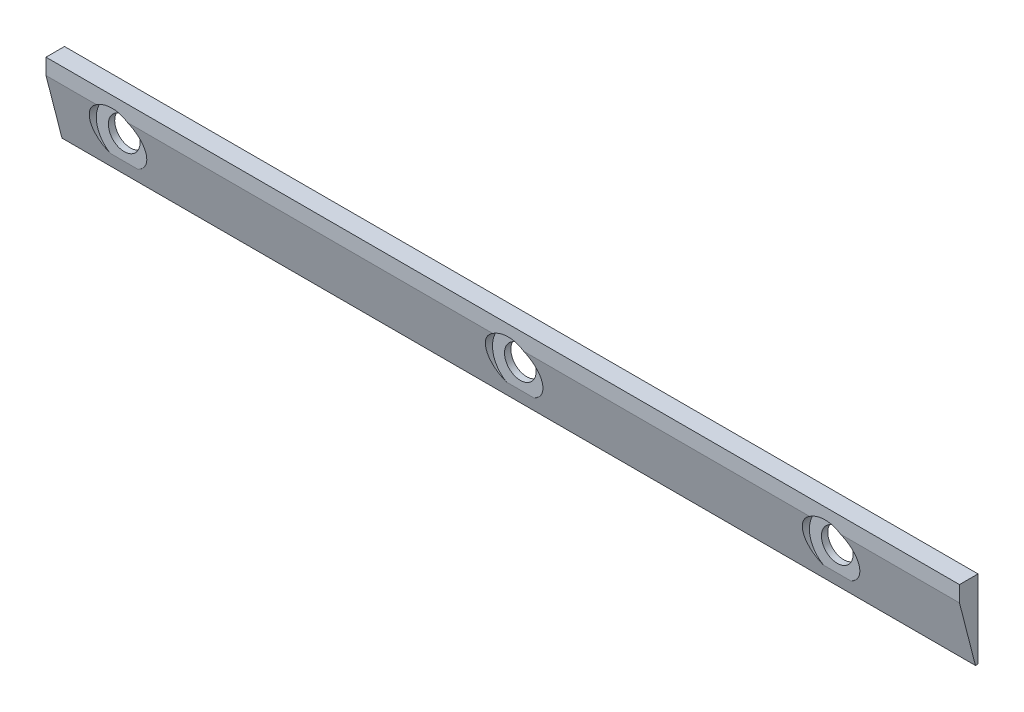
ISO-10303-21;
HEADER;
FILE_DESCRIPTION(('STEP AP214'),'2;1');
FILE_NAME('part.step','',(''),(''),'','','');
FILE_SCHEMA(('AUTOMOTIVE_DESIGN { 1 0 10303 214 1 1 1 1 }'));
ENDSEC;
DATA;
#1=APPLICATION_CONTEXT('core data for automotive mechanical design processes');
#2=APPLICATION_PROTOCOL_DEFINITION('international standard','automotive_design',2000,#1);
#3=PRODUCT_CONTEXT('',#1,'mechanical');
#4=PRODUCT('Part','Part','',(#3));
#5=PRODUCT_RELATED_PRODUCT_CATEGORY('part','',(#4));
#6=PRODUCT_DEFINITION_FORMATION('','',#4);
#7=PRODUCT_DEFINITION_CONTEXT('part definition',#1,'design');
#8=PRODUCT_DEFINITION('design','',#6,#7);
#9=PRODUCT_DEFINITION_SHAPE('','',#8);
#10=(LENGTH_UNIT() NAMED_UNIT(*) SI_UNIT(.MILLI.,.METRE.));
#11=(NAMED_UNIT(*) PLANE_ANGLE_UNIT() SI_UNIT($,.RADIAN.));
#12=(NAMED_UNIT(*) SI_UNIT($,.STERADIAN.) SOLID_ANGLE_UNIT());
#13=UNCERTAINTY_MEASURE_WITH_UNIT(LENGTH_MEASURE(1.E-05),#10,'distance_accuracy_value','');
#14=(GEOMETRIC_REPRESENTATION_CONTEXT(3) GLOBAL_UNCERTAINTY_ASSIGNED_CONTEXT((#13)) GLOBAL_UNIT_ASSIGNED_CONTEXT((#10,
#11,#12)) REPRESENTATION_CONTEXT('',''));
#15=CARTESIAN_POINT('',(0.,0.,0.));
#16=DIRECTION('',(0.,0.,1.));
#17=DIRECTION('',(1.,0.,0.));
#18=AXIS2_PLACEMENT_3D('',#15,#16,#17);
#19=CARTESIAN_POINT('',(45.7581,0.,0.));
#20=DIRECTION('',(0.,-1.,0.));
#21=DIRECTION('',(0.,0.,-1.));
#22=AXIS2_PLACEMENT_3D('',#19,#20,#21);
#23=PLANE('',#22);
#24=DIRECTION('',(0.,0.,1.));
#25=VECTOR('',#24,1.);
#26=CARTESIAN_POINT('',(-45.7581,0.,0.));
#27=LINE('',#26,#25);
#28=CARTESIAN_POINT('',(-45.7581,0.,0.));
#29=VERTEX_POINT('',#28);
#30=CARTESIAN_POINT('',(-45.7581,0.,1.8542));
#31=VERTEX_POINT('',#30);
#32=EDGE_CURVE('E172',#29,#31,#27,.T.);
#33=ORIENTED_EDGE('',*,*,#32,.T.);
#34=DIRECTION('',(-1.,0.,0.));
#35=VECTOR('',#34,1.);
#36=CARTESIAN_POINT('',(45.7581,0.,1.8542));
#37=LINE('',#36,#35);
#38=CARTESIAN_POINT('',(45.7581,0.,1.8542));
#39=VERTEX_POINT('',#38);
#40=EDGE_CURVE('E208',#39,#31,#37,.T.);
#41=ORIENTED_EDGE('',*,*,#40,.F.);
#42=DIRECTION('',(0.,0.,1.));
#43=VECTOR('',#42,1.);
#44=CARTESIAN_POINT('',(45.7581,0.,0.));
#45=LINE('',#44,#43);
#46=CARTESIAN_POINT('',(45.7581,0.,0.));
#47=VERTEX_POINT('',#46);
#48=EDGE_CURVE('E173',#47,#39,#45,.T.);
#49=ORIENTED_EDGE('',*,*,#48,.F.);
#50=DIRECTION('',(-1.,0.,0.));
#51=VECTOR('',#50,1.);
#52=CARTESIAN_POINT('',(45.7581,0.,0.));
#53=LINE('',#52,#51);
#54=EDGE_CURVE('E185',#47,#29,#53,.T.);
#55=ORIENTED_EDGE('',*,*,#54,.T.);
#56=EDGE_LOOP('',(#33,#41,#49,#55));
#57=FACE_BOUND('',#56,.T.);
#58=ADVANCED_FACE('F35',(#57),#23,.F.);
#59=CARTESIAN_POINT('',(45.7581,0.,1.8542));
#60=DIRECTION('',(0.,0.,-1.));
#61=DIRECTION('',(0.,1.,0.));
#62=AXIS2_PLACEMENT_3D('',#59,#60,#61);
#63=PLANE('',#62);
#64=DIRECTION('',(-1.,0.,0.));
#65=VECTOR('',#64,1.);
#66=CARTESIAN_POINT('',(45.7581,-1.5875,1.8542));
#67=LINE('',#66,#65);
#68=CARTESIAN_POINT('',(-40.6922046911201,-1.5875,1.8542));
#69=VERTEX_POINT('',#68);
#70=CARTESIAN_POINT('',(-45.7581,-1.5875,1.8542));
#71=VERTEX_POINT('',#70);
#72=EDGE_CURVE('E204',#69,#71,#67,.T.);
#73=ORIENTED_EDGE('',*,*,#72,.F.);
#74=CARTESIAN_POINT('',(-39.1414,-3.9116,1.8542));
#75=DIRECTION('',(0.,0.,-1.));
#76=DIRECTION('',(0.,1.,0.));
#77=AXIS2_PLACEMENT_3D('',#74,#75,#76);
#78=CIRCLE('',#77,2.794);
#79=CARTESIAN_POINT('',(-37.5905953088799,-1.5875,1.8542));
#80=VERTEX_POINT('',#79);
#81=EDGE_CURVE('E124',#69,#80,#78,.T.);
#82=ORIENTED_EDGE('',*,*,#81,.T.);
#83=CARTESIAN_POINT('',(-1.00470469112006,-1.5875,1.8542));
#84=VERTEX_POINT('',#83);
#85=EDGE_CURVE('E130',#84,#80,#67,.T.);
#86=ORIENTED_EDGE('',*,*,#85,.F.);
#87=CARTESIAN_POINT('',(0.546100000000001,-3.9116,1.8542));
#88=DIRECTION('',(0.,0.,-1.));
#89=DIRECTION('',(0.,1.,0.));
#90=AXIS2_PLACEMENT_3D('',#87,#88,#89);
#91=CIRCLE('',#90,2.794);
#92=CARTESIAN_POINT('',(2.09690469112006,-1.5875,1.8542));
#93=VERTEX_POINT('',#92);
#94=EDGE_CURVE('E147',#84,#93,#91,.T.);
#95=ORIENTED_EDGE('',*,*,#94,.T.);
#96=CARTESIAN_POINT('',(30.7452953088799,-1.5875,1.8542));
#97=VERTEX_POINT('',#96);
#98=EDGE_CURVE('E209',#97,#93,#67,.T.);
#99=ORIENTED_EDGE('',*,*,#98,.F.);
#100=CARTESIAN_POINT('',(32.2961,-3.9116,1.8542));
#101=DIRECTION('',(0.,0.,-1.));
#102=DIRECTION('',(0.,1.,0.));
#103=AXIS2_PLACEMENT_3D('',#100,#101,#102);
#104=CIRCLE('',#103,2.794);
#105=CARTESIAN_POINT('',(33.8469046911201,-1.5875,1.8542));
#106=VERTEX_POINT('',#105);
#107=EDGE_CURVE('E154',#97,#106,#104,.T.);
#108=ORIENTED_EDGE('',*,*,#107,.T.);
#109=CARTESIAN_POINT('',(45.7581,-1.5875,1.8542));
#110=VERTEX_POINT('',#109);
#111=EDGE_CURVE('E205',#110,#106,#67,.T.);
#112=ORIENTED_EDGE('',*,*,#111,.F.);
#113=DIRECTION('',(0.,-1.,0.));
#114=VECTOR('',#113,1.);
#115=CARTESIAN_POINT('',(45.7581,0.,1.8542));
#116=LINE('',#115,#114);
#117=EDGE_CURVE('E176',#39,#110,#116,.T.);
#118=ORIENTED_EDGE('',*,*,#117,.F.);
#119=ORIENTED_EDGE('',*,*,#40,.T.);
#120=DIRECTION('',(0.,-1.,0.));
#121=VECTOR('',#120,1.);
#122=CARTESIAN_POINT('',(-45.7581,0.,1.8542));
#123=LINE('',#122,#121);
#124=EDGE_CURVE('E188',#31,#71,#123,.T.);
#125=ORIENTED_EDGE('',*,*,#124,.T.);
#126=EDGE_LOOP('',(#73,#82,#86,#95,#99,#108,#112,#118,#119,#125));
#127=FACE_BOUND('',#126,.T.);
#128=ADVANCED_FACE('F220',(#127),#63,.F.);
#129=CARTESIAN_POINT('',(45.7581,-7.8232,0.253999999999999));
#130=DIRECTION('',(0.,0.248565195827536,-0.968615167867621));
#131=DIRECTION('',(0.,0.968615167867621,0.248565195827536));
#132=AXIS2_PLACEMENT_3D('',#129,#130,#131);
#133=PLANE('',#132);
#134=DIRECTION('',(-1.,0.,0.));
#135=VECTOR('',#134,1.);
#136=CARTESIAN_POINT('',(45.7581,-6.33850952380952,0.634999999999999));
#137=LINE('',#136,#135);
#138=CARTESIAN_POINT('',(-37.7570062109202,-6.33850952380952,0.634999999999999));
#139=VERTEX_POINT('',#138);
#140=CARTESIAN_POINT('',(-40.5257937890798,-6.33850952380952,0.634999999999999));
#141=VERTEX_POINT('',#140);
#142=EDGE_CURVE('E115',#139,#141,#137,.T.);
#143=ORIENTED_EDGE('',*,*,#142,.T.);
#144=CARTESIAN_POINT('',(-39.1414,-3.9116,1.25779144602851));
#145=DIRECTION('',(0.,0.248565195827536,-0.968615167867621));
#146=DIRECTION('',(0.,-0.968615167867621,-0.248565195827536));
#147=AXIS2_PLACEMENT_3D('',#144,#145,#146);
#148=ELLIPSE('',#147,2.88453050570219,2.794);
#149=EDGE_CURVE('E11',#141,#69,#148,.T.);
#150=ORIENTED_EDGE('',*,*,#149,.T.);
#151=ORIENTED_EDGE('',*,*,#72,.T.);
#152=DIRECTION('',(0.,-0.96861516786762,-0.248565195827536));
#153=VECTOR('',#152,1.);
#154=CARTESIAN_POINT('',(-45.7581,-7.8232,0.253999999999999));
#155=LINE('',#154,#153);
#156=CARTESIAN_POINT('',(-45.7581,-7.8232,0.253999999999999));
#157=VERTEX_POINT('',#156);
#158=EDGE_CURVE('E191',#71,#157,#155,.T.);
#159=ORIENTED_EDGE('',*,*,#158,.T.);
#160=DIRECTION('',(-1.,0.,0.));
#161=VECTOR('',#160,1.);
#162=CARTESIAN_POINT('',(45.7581,-7.8232,0.253999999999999));
#163=LINE('',#162,#161);
#164=CARTESIAN_POINT('',(45.7581,-7.8232,0.253999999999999));
#165=VERTEX_POINT('',#164);
#166=EDGE_CURVE('E201',#165,#157,#163,.T.);
#167=ORIENTED_EDGE('',*,*,#166,.F.);
#168=DIRECTION('',(0.,-0.96861516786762,-0.248565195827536));
#169=VECTOR('',#168,1.);
#170=CARTESIAN_POINT('',(45.7581,-7.8232,0.253999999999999));
#171=LINE('',#170,#169);
#172=EDGE_CURVE('E179',#110,#165,#171,.T.);
#173=ORIENTED_EDGE('',*,*,#172,.F.);
#174=ORIENTED_EDGE('',*,*,#111,.T.);
#175=CARTESIAN_POINT('',(32.2961,-3.9116,1.25779144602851));
#176=DIRECTION('',(0.,0.248565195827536,-0.968615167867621));
#177=DIRECTION('',(0.,-0.968615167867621,-0.248565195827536));
#178=AXIS2_PLACEMENT_3D('',#175,#176,#177);
#179=ELLIPSE('',#178,2.88453050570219,2.794);
#180=CARTESIAN_POINT('',(33.6804937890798,-6.33850952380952,0.634999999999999));
#181=VERTEX_POINT('',#180);
#182=EDGE_CURVE('E212',#106,#181,#179,.T.);
#183=ORIENTED_EDGE('',*,*,#182,.T.);
#184=DIRECTION('',(-1.,0.,0.));
#185=VECTOR('',#184,1.);
#186=CARTESIAN_POINT('',(45.7581,-6.33850952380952,0.634999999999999));
#187=LINE('',#186,#185);
#188=CARTESIAN_POINT('',(30.9117062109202,-6.33850952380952,0.634999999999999));
#189=VERTEX_POINT('',#188);
#190=EDGE_CURVE('E160',#181,#189,#187,.T.);
#191=ORIENTED_EDGE('',*,*,#190,.T.);
#192=EDGE_CURVE('E136',#189,#97,#179,.T.);
#193=ORIENTED_EDGE('',*,*,#192,.T.);
#194=ORIENTED_EDGE('',*,*,#98,.T.);
#195=CARTESIAN_POINT('',(0.546100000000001,-3.9116,1.25779144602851));
#196=DIRECTION('',(0.,0.248565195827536,-0.968615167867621));
#197=DIRECTION('',(0.,-0.968615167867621,-0.248565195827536));
#198=AXIS2_PLACEMENT_3D('',#195,#196,#197);
#199=ELLIPSE('',#198,2.88453050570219,2.794);
#200=CARTESIAN_POINT('',(1.93049378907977,-6.33850952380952,0.634999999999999));
#201=VERTEX_POINT('',#200);
#202=EDGE_CURVE('E132',#93,#201,#199,.T.);
#203=ORIENTED_EDGE('',*,*,#202,.T.);
#204=DIRECTION('',(-1.,0.,0.));
#205=VECTOR('',#204,1.);
#206=CARTESIAN_POINT('',(45.7581,-6.33850952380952,0.634999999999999));
#207=LINE('',#206,#205);
#208=CARTESIAN_POINT('',(-0.838293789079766,-6.33850952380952,0.634999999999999));
#209=VERTEX_POINT('',#208);
#210=EDGE_CURVE('E151',#201,#209,#207,.T.);
#211=ORIENTED_EDGE('',*,*,#210,.T.);
#212=EDGE_CURVE('E131',#209,#84,#199,.T.);
#213=ORIENTED_EDGE('',*,*,#212,.T.);
#214=ORIENTED_EDGE('',*,*,#85,.T.);
#215=EDGE_CURVE('E38',#80,#139,#148,.T.);
#216=ORIENTED_EDGE('',*,*,#215,.T.);
#217=EDGE_LOOP('',(#143,#150,#151,#159,#167,#173,#174,#183,#191,#193,#194,#203,#211,#213,#214,#216));
#218=FACE_BOUND('',#217,.T.);
#219=ADVANCED_FACE('F127',(#218),#133,.F.);
#220=CARTESIAN_POINT('',(45.7581,-7.8232,0.));
#221=DIRECTION('',(0.,1.,0.));
#222=DIRECTION('',(0.,0.,1.));
#223=AXIS2_PLACEMENT_3D('',#220,#221,#222);
#224=PLANE('',#223);
#225=DIRECTION('',(0.,0.,-1.));
#226=VECTOR('',#225,1.);
#227=CARTESIAN_POINT('',(-45.7581,-7.8232,0.));
#228=LINE('',#227,#226);
#229=CARTESIAN_POINT('',(-45.7581,-7.8232,0.));
#230=VERTEX_POINT('',#229);
#231=EDGE_CURVE('E193',#157,#230,#228,.T.);
#232=ORIENTED_EDGE('',*,*,#231,.T.);
#233=DIRECTION('',(-1.,0.,0.));
#234=VECTOR('',#233,1.);
#235=CARTESIAN_POINT('',(45.7581,-7.8232,0.));
#236=LINE('',#235,#234);
#237=CARTESIAN_POINT('',(45.7581,-7.8232,0.));
#238=VERTEX_POINT('',#237);
#239=EDGE_CURVE('E198',#238,#230,#236,.T.);
#240=ORIENTED_EDGE('',*,*,#239,.F.);
#241=DIRECTION('',(0.,0.,-1.));
#242=VECTOR('',#241,1.);
#243=CARTESIAN_POINT('',(45.7581,-7.8232,0.));
#244=LINE('',#243,#242);
#245=EDGE_CURVE('E181',#165,#238,#244,.T.);
#246=ORIENTED_EDGE('',*,*,#245,.F.);
#247=ORIENTED_EDGE('',*,*,#166,.T.);
#248=EDGE_LOOP('',(#232,#240,#246,#247));
#249=FACE_BOUND('',#248,.T.);
#250=ADVANCED_FACE('F232',(#249),#224,.F.);
#251=CARTESIAN_POINT('',(45.7581,0.,0.));
#252=DIRECTION('',(0.,0.,1.));
#253=DIRECTION('',(0.,-1.,0.));
#254=AXIS2_PLACEMENT_3D('',#251,#252,#253);
#255=PLANE('',#254);
#256=CARTESIAN_POINT('',(-39.1414,-3.9116,0.));
#257=DIRECTION('',(0.,0.,-1.));
#258=DIRECTION('',(0.,1.,0.));
#259=AXIS2_PLACEMENT_3D('',#256,#257,#258);
#260=CIRCLE('',#259,1.5875);
#261=CARTESIAN_POINT('',(-39.1414,-2.3241,0.));
#262=VERTEX_POINT('',#261);
#263=EDGE_CURVE('E163',#262,#262,#260,.T.);
#264=ORIENTED_EDGE('',*,*,#263,.F.);
#265=EDGE_LOOP('',(#264));
#266=FACE_BOUND('',#265,.T.);
#267=CARTESIAN_POINT('',(0.546100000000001,-3.9116,0.));
#268=DIRECTION('',(0.,0.,-1.));
#269=DIRECTION('',(0.,1.,0.));
#270=AXIS2_PLACEMENT_3D('',#267,#268,#269);
#271=CIRCLE('',#270,1.5875);
#272=CARTESIAN_POINT('',(0.546100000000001,-2.3241,0.));
#273=VERTEX_POINT('',#272);
#274=EDGE_CURVE('E166',#273,#273,#271,.T.);
#275=ORIENTED_EDGE('',*,*,#274,.F.);
#276=EDGE_LOOP('',(#275));
#277=FACE_BOUND('',#276,.T.);
#278=CARTESIAN_POINT('',(32.2961,-3.9116,0.));
#279=DIRECTION('',(0.,0.,-1.));
#280=DIRECTION('',(0.,1.,0.));
#281=AXIS2_PLACEMENT_3D('',#278,#279,#280);
#282=CIRCLE('',#281,1.5875);
#283=CARTESIAN_POINT('',(32.2961,-2.3241,0.));
#284=VERTEX_POINT('',#283);
#285=EDGE_CURVE('E169',#284,#284,#282,.T.);
#286=ORIENTED_EDGE('',*,*,#285,.F.);
#287=EDGE_LOOP('',(#286));
#288=FACE_BOUND('',#287,.T.);
#289=DIRECTION('',(0.,1.,0.));
#290=VECTOR('',#289,1.);
#291=CARTESIAN_POINT('',(-45.7581,0.,0.));
#292=LINE('',#291,#290);
#293=EDGE_CURVE('E177',#230,#29,#292,.T.);
#294=ORIENTED_EDGE('',*,*,#293,.T.);
#295=ORIENTED_EDGE('',*,*,#54,.F.);
#296=DIRECTION('',(0.,1.,0.));
#297=VECTOR('',#296,1.);
#298=CARTESIAN_POINT('',(45.7581,0.,0.));
#299=LINE('',#298,#297);
#300=EDGE_CURVE('E183',#238,#47,#299,.T.);
#301=ORIENTED_EDGE('',*,*,#300,.F.);
#302=ORIENTED_EDGE('',*,*,#239,.T.);
#303=EDGE_LOOP('',(#294,#295,#301,#302));
#304=FACE_BOUND('',#303,.T.);
#305=ADVANCED_FACE('F236',(#266,#277,#288,#304),#255,.F.);
#306=CARTESIAN_POINT('',(45.7581,0.,0.));
#307=DIRECTION('',(1.,0.,0.));
#308=DIRECTION('',(0.,0.,-1.));
#309=AXIS2_PLACEMENT_3D('',#306,#307,#308);
#310=PLANE('',#309);
#311=ORIENTED_EDGE('',*,*,#48,.T.);
#312=ORIENTED_EDGE('',*,*,#117,.T.);
#313=ORIENTED_EDGE('',*,*,#172,.T.);
#314=ORIENTED_EDGE('',*,*,#245,.T.);
#315=ORIENTED_EDGE('',*,*,#300,.T.);
#316=EDGE_LOOP('',(#311,#312,#313,#314,#315));
#317=FACE_BOUND('',#316,.T.);
#318=ADVANCED_FACE('F240',(#317),#310,.T.);
#319=CARTESIAN_POINT('',(-45.7581,0.,0.));
#320=DIRECTION('',(1.,0.,0.));
#321=DIRECTION('',(0.,0.,-1.));
#322=AXIS2_PLACEMENT_3D('',#319,#320,#321);
#323=PLANE('',#322);
#324=ORIENTED_EDGE('',*,*,#32,.F.);
#325=ORIENTED_EDGE('',*,*,#293,.F.);
#326=ORIENTED_EDGE('',*,*,#231,.F.);
#327=ORIENTED_EDGE('',*,*,#158,.F.);
#328=ORIENTED_EDGE('',*,*,#124,.F.);
#329=EDGE_LOOP('',(#324,#325,#326,#327,#328));
#330=FACE_BOUND('',#329,.T.);
#331=ADVANCED_FACE('F228',(#330),#323,.F.);
#332=CARTESIAN_POINT('',(32.2961,-3.9116,1.8542));
#333=DIRECTION('',(0.,0.,-1.));
#334=DIRECTION('',(0.,1.,0.));
#335=AXIS2_PLACEMENT_3D('',#332,#333,#334);
#336=CYLINDRICAL_SURFACE('',#335,1.5875);
#337=CARTESIAN_POINT('',(32.2961,-3.9116,0.635));
#338=DIRECTION('',(0.,0.,-1.));
#339=DIRECTION('',(0.,1.,0.));
#340=AXIS2_PLACEMENT_3D('',#337,#338,#339);
#341=CIRCLE('',#340,1.5875);
#342=CARTESIAN_POINT('',(32.2961,-2.3241,0.635));
#343=VERTEX_POINT('',#342);
#344=EDGE_CURVE('E157',#343,#343,#341,.F.);
#345=CARTESIAN_POINT('',(32.2961,-2.3241,0.635));
#346=CARTESIAN_POINT('',(32.2961,-2.3241,0.628385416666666));
#347=CARTESIAN_POINT('',(32.2961,-2.3241,0.621770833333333));
#348=CARTESIAN_POINT('',(32.2961,-2.3241,0.608541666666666));
#349=CARTESIAN_POINT('',(32.2961,-2.3241,0.601927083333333));
#350=CARTESIAN_POINT('',(32.2961,-2.3241,0.588697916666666));
#351=CARTESIAN_POINT('',(32.2961,-2.3241,0.582083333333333));
#352=CARTESIAN_POINT('',(32.2961,-2.3241,0.568854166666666));
#353=CARTESIAN_POINT('',(32.2961,-2.3241,0.562239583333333));
#354=CARTESIAN_POINT('',(32.2961,-2.3241,0.549010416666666));
#355=CARTESIAN_POINT('',(32.2961,-2.3241,0.542395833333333));
#356=CARTESIAN_POINT('',(32.2961,-2.3241,0.529166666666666));
#357=CARTESIAN_POINT('',(32.2961,-2.3241,0.522552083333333));
#358=CARTESIAN_POINT('',(32.2961,-2.3241,0.509322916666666));
#359=CARTESIAN_POINT('',(32.2961,-2.3241,0.502708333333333));
#360=CARTESIAN_POINT('',(32.2961,-2.3241,0.489479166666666));
#361=CARTESIAN_POINT('',(32.2961,-2.3241,0.482864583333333));
#362=CARTESIAN_POINT('',(32.2961,-2.3241,0.469635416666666));
#363=CARTESIAN_POINT('',(32.2961,-2.3241,0.463020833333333));
#364=CARTESIAN_POINT('',(32.2961,-2.3241,0.449791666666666));
#365=CARTESIAN_POINT('',(32.2961,-2.3241,0.443177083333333));
#366=CARTESIAN_POINT('',(32.2961,-2.3241,0.429947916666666));
#367=CARTESIAN_POINT('',(32.2961,-2.3241,0.423333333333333));
#368=CARTESIAN_POINT('',(32.2961,-2.3241,0.410104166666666));
#369=CARTESIAN_POINT('',(32.2961,-2.3241,0.403489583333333));
#370=CARTESIAN_POINT('',(32.2961,-2.3241,0.390260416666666));
#371=CARTESIAN_POINT('',(32.2961,-2.3241,0.383645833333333));
#372=CARTESIAN_POINT('',(32.2961,-2.3241,0.370416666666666));
#373=CARTESIAN_POINT('',(32.2961,-2.3241,0.363802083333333));
#374=CARTESIAN_POINT('',(32.2961,-2.3241,0.350572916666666));
#375=CARTESIAN_POINT('',(32.2961,-2.3241,0.343958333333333));
#376=CARTESIAN_POINT('',(32.2961,-2.3241,0.330729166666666));
#377=CARTESIAN_POINT('',(32.2961,-2.3241,0.324114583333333));
#378=CARTESIAN_POINT('',(32.2961,-2.3241,0.310885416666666));
#379=CARTESIAN_POINT('',(32.2961,-2.3241,0.304270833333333));
#380=CARTESIAN_POINT('',(32.2961,-2.3241,0.291041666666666));
#381=CARTESIAN_POINT('',(32.2961,-2.3241,0.284427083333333));
#382=CARTESIAN_POINT('',(32.2961,-2.3241,0.271197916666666));
#383=CARTESIAN_POINT('',(32.2961,-2.3241,0.264583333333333));
#384=CARTESIAN_POINT('',(32.2961,-2.3241,0.251354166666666));
#385=CARTESIAN_POINT('',(32.2961,-2.3241,0.244739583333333));
#386=CARTESIAN_POINT('',(32.2961,-2.3241,0.231510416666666));
#387=CARTESIAN_POINT('',(32.2961,-2.3241,0.224895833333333));
#388=CARTESIAN_POINT('',(32.2961,-2.3241,0.211666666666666));
#389=CARTESIAN_POINT('',(32.2961,-2.3241,0.205052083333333));
#390=CARTESIAN_POINT('',(32.2961,-2.3241,0.191822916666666));
#391=CARTESIAN_POINT('',(32.2961,-2.3241,0.185208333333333));
#392=CARTESIAN_POINT('',(32.2961,-2.3241,0.171979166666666));
#393=CARTESIAN_POINT('',(32.2961,-2.3241,0.165364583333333));
#394=CARTESIAN_POINT('',(32.2961,-2.3241,0.152135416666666));
#395=CARTESIAN_POINT('',(32.2961,-2.3241,0.145520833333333));
#396=CARTESIAN_POINT('',(32.2961,-2.3241,0.132291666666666));
#397=CARTESIAN_POINT('',(32.2961,-2.3241,0.125677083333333));
#398=CARTESIAN_POINT('',(32.2961,-2.3241,0.112447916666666));
#399=CARTESIAN_POINT('',(32.2961,-2.3241,0.105833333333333));
#400=CARTESIAN_POINT('',(32.2961,-2.3241,0.0926041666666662));
#401=CARTESIAN_POINT('',(32.2961,-2.3241,0.0859895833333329));
#402=CARTESIAN_POINT('',(32.2961,-2.3241,0.0727604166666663));
#403=CARTESIAN_POINT('',(32.2961,-2.3241,0.066145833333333));
#404=CARTESIAN_POINT('',(32.2961,-2.3241,0.0529166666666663));
#405=CARTESIAN_POINT('',(32.2961,-2.3241,0.0463020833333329));
#406=CARTESIAN_POINT('',(32.2961,-2.3241,0.0330729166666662));
#407=CARTESIAN_POINT('',(32.2961,-2.3241,0.0264583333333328));
#408=CARTESIAN_POINT('',(32.2961,-2.3241,0.0132291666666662));
#409=CARTESIAN_POINT('',(32.2961,-2.3241,0.00661458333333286));
#410=CARTESIAN_POINT('',(32.2961,-2.3241,0.));
#411=B_SPLINE_CURVE_WITH_KNOTS('',3,(#345,#346,#347,#348,#349,#350,#351,#352,#353,#354,#355,
#356,#357,#358,#359,#360,#361,#362,#363,#364,#365,#366,#367,#368,#369,#370,#371,#372,#373,#374,
#375,#376,#377,#378,#379,#380,#381,#382,#383,#384,#385,#386,#387,#388,#389,#390,#391,#392,#393,
#394,#395,#396,#397,#398,#399,#400,#401,#402,#403,#404,#405,#406,#407,#408,#409,#410),
.UNSPECIFIED.,.F.,.F.,(4,2,2,2,2,2,2,2,2,2,2,2,2,2,2,2,2,2,2,2,2,2,2,2,2,2,2,2,2,2,2,2,4),(0.,
0.0198437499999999,0.0396875,0.0595312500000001,0.079375,0.0992187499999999,0.1190625,
0.13890625,0.15875,0.17859375,0.1984375,0.21828125,0.238125,0.25796875,0.2778125,0.29765625,
0.3175,0.33734375,0.3571875,0.37703125,0.396875,0.41671875,0.4365625,0.45640625,0.47625,
0.49609375,0.5159375,0.53578125,0.555625,0.57546875,0.5953125,0.61515625,0.635),.UNSPECIFIED.);
#412=EDGE_CURVE('BSEAM259',#343,#284,#411,.T.);
#413=ORIENTED_EDGE('',*,*,#344,.T.);
#414=ORIENTED_EDGE('',*,*,#285,.T.);
#415=ORIENTED_EDGE('',*,*,#412,.T.);
#416=ORIENTED_EDGE('',*,*,#412,.F.);
#417=EDGE_LOOP('',(#413,#415,#414,#416));
#418=FACE_BOUND('',#417,.T.);
#419=ADVANCED_FACE('F259',(#418),#336,.F.);
#420=CARTESIAN_POINT('',(0.546100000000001,-3.9116,1.8542));
#421=DIRECTION('',(0.,0.,-1.));
#422=DIRECTION('',(0.,1.,0.));
#423=AXIS2_PLACEMENT_3D('',#420,#421,#422);
#424=CYLINDRICAL_SURFACE('',#423,1.5875);
#425=CARTESIAN_POINT('',(0.546100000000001,-3.9116,0.635));
#426=DIRECTION('',(0.,0.,-1.));
#427=DIRECTION('',(0.,1.,0.));
#428=AXIS2_PLACEMENT_3D('',#425,#426,#427);
#429=CIRCLE('',#428,1.5875);
#430=CARTESIAN_POINT('',(0.546100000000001,-2.3241,0.635));
#431=VERTEX_POINT('',#430);
#432=EDGE_CURVE('E138',#431,#431,#429,.F.);
#433=CARTESIAN_POINT('',(0.546100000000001,-2.3241,0.635));
#434=CARTESIAN_POINT('',(0.546100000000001,-2.3241,0.628385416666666));
#435=CARTESIAN_POINT('',(0.546100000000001,-2.3241,0.621770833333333));
#436=CARTESIAN_POINT('',(0.546100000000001,-2.3241,0.608541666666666));
#437=CARTESIAN_POINT('',(0.546100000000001,-2.3241,0.601927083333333));
#438=CARTESIAN_POINT('',(0.546100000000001,-2.3241,0.588697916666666));
#439=CARTESIAN_POINT('',(0.546100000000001,-2.3241,0.582083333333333));
#440=CARTESIAN_POINT('',(0.546100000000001,-2.3241,0.568854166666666));
#441=CARTESIAN_POINT('',(0.546100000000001,-2.3241,0.562239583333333));
#442=CARTESIAN_POINT('',(0.546100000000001,-2.3241,0.549010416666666));
#443=CARTESIAN_POINT('',(0.546100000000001,-2.3241,0.542395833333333));
#444=CARTESIAN_POINT('',(0.546100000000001,-2.3241,0.529166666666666));
#445=CARTESIAN_POINT('',(0.546100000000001,-2.3241,0.522552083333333));
#446=CARTESIAN_POINT('',(0.546100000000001,-2.3241,0.509322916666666));
#447=CARTESIAN_POINT('',(0.546100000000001,-2.3241,0.502708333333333));
#448=CARTESIAN_POINT('',(0.546100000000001,-2.3241,0.489479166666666));
#449=CARTESIAN_POINT('',(0.546100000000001,-2.3241,0.482864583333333));
#450=CARTESIAN_POINT('',(0.546100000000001,-2.3241,0.469635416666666));
#451=CARTESIAN_POINT('',(0.546100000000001,-2.3241,0.463020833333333));
#452=CARTESIAN_POINT('',(0.546100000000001,-2.3241,0.449791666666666));
#453=CARTESIAN_POINT('',(0.546100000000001,-2.3241,0.443177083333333));
#454=CARTESIAN_POINT('',(0.546100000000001,-2.3241,0.429947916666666));
#455=CARTESIAN_POINT('',(0.546100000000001,-2.3241,0.423333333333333));
#456=CARTESIAN_POINT('',(0.546100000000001,-2.3241,0.410104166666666));
#457=CARTESIAN_POINT('',(0.546100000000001,-2.3241,0.403489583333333));
#458=CARTESIAN_POINT('',(0.546100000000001,-2.3241,0.390260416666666));
#459=CARTESIAN_POINT('',(0.546100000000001,-2.3241,0.383645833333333));
#460=CARTESIAN_POINT('',(0.546100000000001,-2.3241,0.370416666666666));
#461=CARTESIAN_POINT('',(0.546100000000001,-2.3241,0.363802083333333));
#462=CARTESIAN_POINT('',(0.546100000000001,-2.3241,0.350572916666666));
#463=CARTESIAN_POINT('',(0.546100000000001,-2.3241,0.343958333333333));
#464=CARTESIAN_POINT('',(0.546100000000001,-2.3241,0.330729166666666));
#465=CARTESIAN_POINT('',(0.546100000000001,-2.3241,0.324114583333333));
#466=CARTESIAN_POINT('',(0.546100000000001,-2.3241,0.310885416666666));
#467=CARTESIAN_POINT('',(0.546100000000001,-2.3241,0.304270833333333));
#468=CARTESIAN_POINT('',(0.546100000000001,-2.3241,0.291041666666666));
#469=CARTESIAN_POINT('',(0.546100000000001,-2.3241,0.284427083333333));
#470=CARTESIAN_POINT('',(0.546100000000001,-2.3241,0.271197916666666));
#471=CARTESIAN_POINT('',(0.546100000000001,-2.3241,0.264583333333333));
#472=CARTESIAN_POINT('',(0.546100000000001,-2.3241,0.251354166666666));
#473=CARTESIAN_POINT('',(0.546100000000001,-2.3241,0.244739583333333));
#474=CARTESIAN_POINT('',(0.546100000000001,-2.3241,0.231510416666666));
#475=CARTESIAN_POINT('',(0.546100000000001,-2.3241,0.224895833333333));
#476=CARTESIAN_POINT('',(0.546100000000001,-2.3241,0.211666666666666));
#477=CARTESIAN_POINT('',(0.546100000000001,-2.3241,0.205052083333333));
#478=CARTESIAN_POINT('',(0.546100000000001,-2.3241,0.191822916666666));
#479=CARTESIAN_POINT('',(0.546100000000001,-2.3241,0.185208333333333));
#480=CARTESIAN_POINT('',(0.546100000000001,-2.3241,0.171979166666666));
#481=CARTESIAN_POINT('',(0.546100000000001,-2.3241,0.165364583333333));
#482=CARTESIAN_POINT('',(0.546100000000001,-2.3241,0.152135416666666));
#483=CARTESIAN_POINT('',(0.546100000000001,-2.3241,0.145520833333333));
#484=CARTESIAN_POINT('',(0.546100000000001,-2.3241,0.132291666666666));
#485=CARTESIAN_POINT('',(0.546100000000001,-2.3241,0.125677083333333));
#486=CARTESIAN_POINT('',(0.546100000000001,-2.3241,0.112447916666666));
#487=CARTESIAN_POINT('',(0.546100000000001,-2.3241,0.105833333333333));
#488=CARTESIAN_POINT('',(0.546100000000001,-2.3241,0.0926041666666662));
#489=CARTESIAN_POINT('',(0.546100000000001,-2.3241,0.0859895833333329));
#490=CARTESIAN_POINT('',(0.546100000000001,-2.3241,0.0727604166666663));
#491=CARTESIAN_POINT('',(0.546100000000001,-2.3241,0.066145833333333));
#492=CARTESIAN_POINT('',(0.546100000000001,-2.3241,0.0529166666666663));
#493=CARTESIAN_POINT('',(0.546100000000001,-2.3241,0.0463020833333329));
#494=CARTESIAN_POINT('',(0.546100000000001,-2.3241,0.0330729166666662));
#495=CARTESIAN_POINT('',(0.546100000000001,-2.3241,0.0264583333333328));
#496=CARTESIAN_POINT('',(0.546100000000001,-2.3241,0.0132291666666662));
#497=CARTESIAN_POINT('',(0.546100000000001,-2.3241,0.00661458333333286));
#498=CARTESIAN_POINT('',(0.546100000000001,-2.3241,0.));
#499=B_SPLINE_CURVE_WITH_KNOTS('',3,(#433,#434,#435,#436,#437,#438,#439,#440,#441,#442,#443,
#444,#445,#446,#447,#448,#449,#450,#451,#452,#453,#454,#455,#456,#457,#458,#459,#460,#461,#462,
#463,#464,#465,#466,#467,#468,#469,#470,#471,#472,#473,#474,#475,#476,#477,#478,#479,#480,#481,
#482,#483,#484,#485,#486,#487,#488,#489,#490,#491,#492,#493,#494,#495,#496,#497,#498),
.UNSPECIFIED.,.F.,.F.,(4,2,2,2,2,2,2,2,2,2,2,2,2,2,2,2,2,2,2,2,2,2,2,2,2,2,2,2,2,2,2,2,4),(0.,
0.0198437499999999,0.0396875,0.0595312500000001,0.079375,0.0992187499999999,0.1190625,
0.13890625,0.15875,0.17859375,0.1984375,0.21828125,0.238125,0.25796875,0.2778125,0.29765625,
0.3175,0.33734375,0.3571875,0.37703125,0.396875,0.41671875,0.4365625,0.45640625,0.47625,
0.49609375,0.5159375,0.53578125,0.555625,0.57546875,0.5953125,0.61515625,0.635),.UNSPECIFIED.);
#500=EDGE_CURVE('BSEAM264',#431,#273,#499,.T.);
#501=ORIENTED_EDGE('',*,*,#432,.T.);
#502=ORIENTED_EDGE('',*,*,#274,.T.);
#503=ORIENTED_EDGE('',*,*,#500,.T.);
#504=ORIENTED_EDGE('',*,*,#500,.F.);
#505=EDGE_LOOP('',(#501,#503,#502,#504));
#506=FACE_BOUND('',#505,.T.);
#507=ADVANCED_FACE('F264',(#506),#424,.F.);
#508=CARTESIAN_POINT('',(-39.1414,-3.9116,1.8542));
#509=DIRECTION('',(0.,0.,-1.));
#510=DIRECTION('',(0.,1.,0.));
#511=AXIS2_PLACEMENT_3D('',#508,#509,#510);
#512=CYLINDRICAL_SURFACE('',#511,1.5875);
#513=CARTESIAN_POINT('',(-39.1414,-3.9116,0.635));
#514=DIRECTION('',(0.,0.,-1.));
#515=DIRECTION('',(0.,1.,0.));
#516=AXIS2_PLACEMENT_3D('',#513,#514,#515);
#517=CIRCLE('',#516,1.5875);
#518=CARTESIAN_POINT('',(-39.1414,-2.3241,0.635));
#519=VERTEX_POINT('',#518);
#520=EDGE_CURVE('E119',#519,#519,#517,.F.);
#521=CARTESIAN_POINT('',(-39.1414,-2.3241,0.635));
#522=CARTESIAN_POINT('',(-39.1414,-2.3241,0.628385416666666));
#523=CARTESIAN_POINT('',(-39.1414,-2.3241,0.621770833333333));
#524=CARTESIAN_POINT('',(-39.1414,-2.3241,0.608541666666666));
#525=CARTESIAN_POINT('',(-39.1414,-2.3241,0.601927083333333));
#526=CARTESIAN_POINT('',(-39.1414,-2.3241,0.588697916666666));
#527=CARTESIAN_POINT('',(-39.1414,-2.3241,0.582083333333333));
#528=CARTESIAN_POINT('',(-39.1414,-2.3241,0.568854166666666));
#529=CARTESIAN_POINT('',(-39.1414,-2.3241,0.562239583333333));
#530=CARTESIAN_POINT('',(-39.1414,-2.3241,0.549010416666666));
#531=CARTESIAN_POINT('',(-39.1414,-2.3241,0.542395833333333));
#532=CARTESIAN_POINT('',(-39.1414,-2.3241,0.529166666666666));
#533=CARTESIAN_POINT('',(-39.1414,-2.3241,0.522552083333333));
#534=CARTESIAN_POINT('',(-39.1414,-2.3241,0.509322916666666));
#535=CARTESIAN_POINT('',(-39.1414,-2.3241,0.502708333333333));
#536=CARTESIAN_POINT('',(-39.1414,-2.3241,0.489479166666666));
#537=CARTESIAN_POINT('',(-39.1414,-2.3241,0.482864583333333));
#538=CARTESIAN_POINT('',(-39.1414,-2.3241,0.469635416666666));
#539=CARTESIAN_POINT('',(-39.1414,-2.3241,0.463020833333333));
#540=CARTESIAN_POINT('',(-39.1414,-2.3241,0.449791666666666));
#541=CARTESIAN_POINT('',(-39.1414,-2.3241,0.443177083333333));
#542=CARTESIAN_POINT('',(-39.1414,-2.3241,0.429947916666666));
#543=CARTESIAN_POINT('',(-39.1414,-2.3241,0.423333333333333));
#544=CARTESIAN_POINT('',(-39.1414,-2.3241,0.410104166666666));
#545=CARTESIAN_POINT('',(-39.1414,-2.3241,0.403489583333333));
#546=CARTESIAN_POINT('',(-39.1414,-2.3241,0.390260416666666));
#547=CARTESIAN_POINT('',(-39.1414,-2.3241,0.383645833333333));
#548=CARTESIAN_POINT('',(-39.1414,-2.3241,0.370416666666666));
#549=CARTESIAN_POINT('',(-39.1414,-2.3241,0.363802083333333));
#550=CARTESIAN_POINT('',(-39.1414,-2.3241,0.350572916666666));
#551=CARTESIAN_POINT('',(-39.1414,-2.3241,0.343958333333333));
#552=CARTESIAN_POINT('',(-39.1414,-2.3241,0.330729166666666));
#553=CARTESIAN_POINT('',(-39.1414,-2.3241,0.324114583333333));
#554=CARTESIAN_POINT('',(-39.1414,-2.3241,0.310885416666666));
#555=CARTESIAN_POINT('',(-39.1414,-2.3241,0.304270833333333));
#556=CARTESIAN_POINT('',(-39.1414,-2.3241,0.291041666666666));
#557=CARTESIAN_POINT('',(-39.1414,-2.3241,0.284427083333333));
#558=CARTESIAN_POINT('',(-39.1414,-2.3241,0.271197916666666));
#559=CARTESIAN_POINT('',(-39.1414,-2.3241,0.264583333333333));
#560=CARTESIAN_POINT('',(-39.1414,-2.3241,0.251354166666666));
#561=CARTESIAN_POINT('',(-39.1414,-2.3241,0.244739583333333));
#562=CARTESIAN_POINT('',(-39.1414,-2.3241,0.231510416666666));
#563=CARTESIAN_POINT('',(-39.1414,-2.3241,0.224895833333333));
#564=CARTESIAN_POINT('',(-39.1414,-2.3241,0.211666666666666));
#565=CARTESIAN_POINT('',(-39.1414,-2.3241,0.205052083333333));
#566=CARTESIAN_POINT('',(-39.1414,-2.3241,0.191822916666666));
#567=CARTESIAN_POINT('',(-39.1414,-2.3241,0.185208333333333));
#568=CARTESIAN_POINT('',(-39.1414,-2.3241,0.171979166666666));
#569=CARTESIAN_POINT('',(-39.1414,-2.3241,0.165364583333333));
#570=CARTESIAN_POINT('',(-39.1414,-2.3241,0.152135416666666));
#571=CARTESIAN_POINT('',(-39.1414,-2.3241,0.145520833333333));
#572=CARTESIAN_POINT('',(-39.1414,-2.3241,0.132291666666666));
#573=CARTESIAN_POINT('',(-39.1414,-2.3241,0.125677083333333));
#574=CARTESIAN_POINT('',(-39.1414,-2.3241,0.112447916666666));
#575=CARTESIAN_POINT('',(-39.1414,-2.3241,0.105833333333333));
#576=CARTESIAN_POINT('',(-39.1414,-2.3241,0.0926041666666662));
#577=CARTESIAN_POINT('',(-39.1414,-2.3241,0.0859895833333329));
#578=CARTESIAN_POINT('',(-39.1414,-2.3241,0.0727604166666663));
#579=CARTESIAN_POINT('',(-39.1414,-2.3241,0.066145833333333));
#580=CARTESIAN_POINT('',(-39.1414,-2.3241,0.0529166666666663));
#581=CARTESIAN_POINT('',(-39.1414,-2.3241,0.0463020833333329));
#582=CARTESIAN_POINT('',(-39.1414,-2.3241,0.0330729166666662));
#583=CARTESIAN_POINT('',(-39.1414,-2.3241,0.0264583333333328));
#584=CARTESIAN_POINT('',(-39.1414,-2.3241,0.0132291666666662));
#585=CARTESIAN_POINT('',(-39.1414,-2.3241,0.00661458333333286));
#586=CARTESIAN_POINT('',(-39.1414,-2.3241,0.));
#587=B_SPLINE_CURVE_WITH_KNOTS('',3,(#521,#522,#523,#524,#525,#526,#527,#528,#529,#530,#531,
#532,#533,#534,#535,#536,#537,#538,#539,#540,#541,#542,#543,#544,#545,#546,#547,#548,#549,#550,
#551,#552,#553,#554,#555,#556,#557,#558,#559,#560,#561,#562,#563,#564,#565,#566,#567,#568,#569,
#570,#571,#572,#573,#574,#575,#576,#577,#578,#579,#580,#581,#582,#583,#584,#585,#586),
.UNSPECIFIED.,.F.,.F.,(4,2,2,2,2,2,2,2,2,2,2,2,2,2,2,2,2,2,2,2,2,2,2,2,2,2,2,2,2,2,2,2,4),(0.,
0.0198437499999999,0.0396875,0.0595312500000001,0.079375,0.0992187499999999,0.1190625,
0.13890625,0.15875,0.17859375,0.1984375,0.21828125,0.238125,0.25796875,0.2778125,0.29765625,
0.3175,0.33734375,0.3571875,0.37703125,0.396875,0.41671875,0.4365625,0.45640625,0.47625,
0.49609375,0.5159375,0.53578125,0.555625,0.57546875,0.5953125,0.61515625,0.635),.UNSPECIFIED.);
#588=EDGE_CURVE('BSEAM268',#519,#262,#587,.T.);
#589=ORIENTED_EDGE('',*,*,#520,.T.);
#590=ORIENTED_EDGE('',*,*,#263,.T.);
#591=ORIENTED_EDGE('',*,*,#588,.T.);
#592=ORIENTED_EDGE('',*,*,#588,.F.);
#593=EDGE_LOOP('',(#589,#591,#590,#592));
#594=FACE_BOUND('',#593,.T.);
#595=ADVANCED_FACE('F268',(#594),#512,.F.);
#596=CARTESIAN_POINT('',(32.2961,-3.9116,1.8542));
#597=DIRECTION('',(0.,0.,-1.));
#598=DIRECTION('',(0.,1.,0.));
#599=AXIS2_PLACEMENT_3D('',#596,#597,#598);
#600=CYLINDRICAL_SURFACE('',#599,2.794);
#601=CARTESIAN_POINT('',(32.2961,-3.9116,0.635));
#602=DIRECTION('',(0.,0.,-1.));
#603=DIRECTION('',(0.,1.,0.));
#604=AXIS2_PLACEMENT_3D('',#601,#602,#603);
#605=CIRCLE('',#604,2.794);
#606=EDGE_CURVE('E153',#189,#181,#605,.T.);
#607=ORIENTED_EDGE('',*,*,#606,.T.);
#608=ORIENTED_EDGE('',*,*,#182,.F.);
#609=ORIENTED_EDGE('',*,*,#107,.F.);
#610=ORIENTED_EDGE('',*,*,#192,.F.);
#611=EDGE_LOOP('',(#607,#608,#609,#610));
#612=FACE_BOUND('',#611,.T.);
#613=ADVANCED_FACE('F272',(#612),#600,.F.);
#614=CARTESIAN_POINT('',(32.2961,-3.9116,0.635));
#615=DIRECTION('',(0.,0.,-1.));
#616=DIRECTION('',(0.,1.,0.));
#617=AXIS2_PLACEMENT_3D('',#614,#615,#616);
#618=PLANE('',#617);
#619=ORIENTED_EDGE('',*,*,#344,.F.);
#620=EDGE_LOOP('',(#619));
#621=FACE_BOUND('',#620,.T.);
#622=ORIENTED_EDGE('',*,*,#606,.F.);
#623=ORIENTED_EDGE('',*,*,#190,.F.);
#624=EDGE_LOOP('',(#622,#623));
#625=FACE_BOUND('',#624,.T.);
#626=ADVANCED_FACE('F275',(#621,#625),#618,.F.);
#627=CARTESIAN_POINT('',(0.546100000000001,-3.9116,1.8542));
#628=DIRECTION('',(0.,0.,-1.));
#629=DIRECTION('',(0.,1.,0.));
#630=AXIS2_PLACEMENT_3D('',#627,#628,#629);
#631=CYLINDRICAL_SURFACE('',#630,2.794);
#632=CARTESIAN_POINT('',(0.546100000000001,-3.9116,0.635));
#633=DIRECTION('',(0.,0.,-1.));
#634=DIRECTION('',(0.,1.,0.));
#635=AXIS2_PLACEMENT_3D('',#632,#633,#634);
#636=CIRCLE('',#635,2.794);
#637=EDGE_CURVE('E55',#209,#201,#636,.T.);
#638=ORIENTED_EDGE('',*,*,#637,.T.);
#639=ORIENTED_EDGE('',*,*,#202,.F.);
#640=ORIENTED_EDGE('',*,*,#94,.F.);
#641=ORIENTED_EDGE('',*,*,#212,.F.);
#642=EDGE_LOOP('',(#638,#639,#640,#641));
#643=FACE_BOUND('',#642,.T.);
#644=ADVANCED_FACE('F278',(#643),#631,.F.);
#645=CARTESIAN_POINT('',(0.546100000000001,-3.9116,0.635));
#646=DIRECTION('',(0.,0.,-1.));
#647=DIRECTION('',(0.,1.,0.));
#648=AXIS2_PLACEMENT_3D('',#645,#646,#647);
#649=PLANE('',#648);
#650=ORIENTED_EDGE('',*,*,#432,.F.);
#651=EDGE_LOOP('',(#650));
#652=FACE_BOUND('',#651,.T.);
#653=ORIENTED_EDGE('',*,*,#637,.F.);
#654=ORIENTED_EDGE('',*,*,#210,.F.);
#655=EDGE_LOOP('',(#653,#654));
#656=FACE_BOUND('',#655,.T.);
#657=ADVANCED_FACE('F282',(#652,#656),#649,.F.);
#658=CARTESIAN_POINT('',(-39.1414,-3.9116,1.8542));
#659=DIRECTION('',(0.,0.,-1.));
#660=DIRECTION('',(0.,1.,0.));
#661=AXIS2_PLACEMENT_3D('',#658,#659,#660);
#662=CYLINDRICAL_SURFACE('',#661,2.794);
#663=CARTESIAN_POINT('',(-39.1414,-3.9116,0.635));
#664=DIRECTION('',(0.,0.,-1.));
#665=DIRECTION('',(0.,1.,0.));
#666=AXIS2_PLACEMENT_3D('',#663,#664,#665);
#667=CIRCLE('',#666,2.794);
#668=EDGE_CURVE('E48',#141,#139,#667,.T.);
#669=ORIENTED_EDGE('',*,*,#668,.T.);
#670=ORIENTED_EDGE('',*,*,#215,.F.);
#671=ORIENTED_EDGE('',*,*,#81,.F.);
#672=ORIENTED_EDGE('',*,*,#149,.F.);
#673=EDGE_LOOP('',(#669,#670,#671,#672));
#674=FACE_BOUND('',#673,.T.);
#675=ADVANCED_FACE('F122',(#674),#662,.F.);
#676=CARTESIAN_POINT('',(-39.1414,-3.9116,0.635));
#677=DIRECTION('',(0.,0.,-1.));
#678=DIRECTION('',(0.,1.,0.));
#679=AXIS2_PLACEMENT_3D('',#676,#677,#678);
#680=PLANE('',#679);
#681=ORIENTED_EDGE('',*,*,#520,.F.);
#682=EDGE_LOOP('',(#681));
#683=FACE_BOUND('',#682,.T.);
#684=ORIENTED_EDGE('',*,*,#668,.F.);
#685=ORIENTED_EDGE('',*,*,#142,.F.);
#686=EDGE_LOOP('',(#684,#685));
#687=FACE_BOUND('',#686,.T.);
#688=ADVANCED_FACE('F116',(#683,#687),#680,.F.);
#689=CLOSED_SHELL('',(#58,#128,#219,#250,#305,#318,#331,#419,#507,#595,#613,#626,#644,#657,#675,#688));
#690=MANIFOLD_SOLID_BREP('B2',#689);
#691=ADVANCED_BREP_SHAPE_REPRESENTATION('',(#18,#690),#14);
#692=SHAPE_DEFINITION_REPRESENTATION(#9,#691);
ENDSEC;
END-ISO-10303-21;
